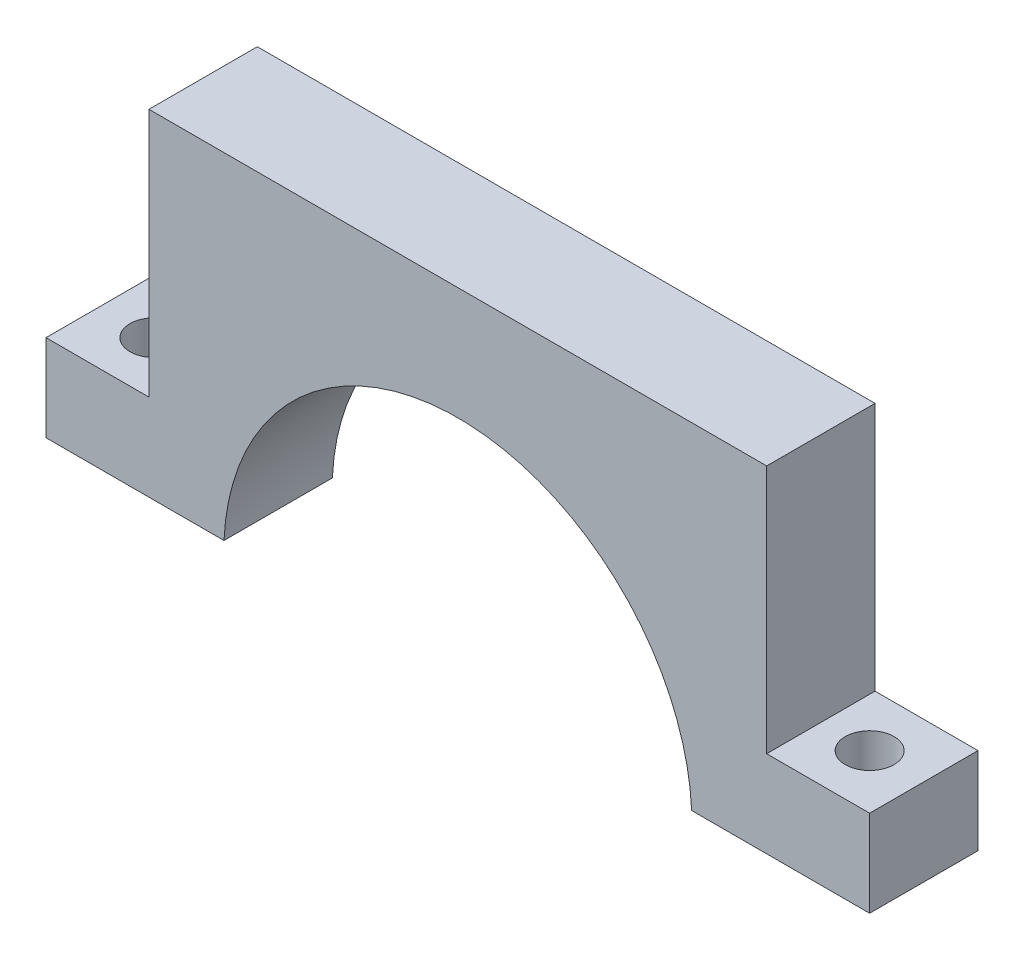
ISO-10303-21;
HEADER;
FILE_DESCRIPTION(('STEP AP214'),'2;1');
FILE_NAME('part.step','',(''),(''),'','','');
FILE_SCHEMA(('AUTOMOTIVE_DESIGN { 1 0 10303 214 1 1 1 1 }'));
ENDSEC;
DATA;
#1=APPLICATION_CONTEXT('core data for automotive mechanical design processes');
#2=APPLICATION_PROTOCOL_DEFINITION('international standard','automotive_design',2000,#1);
#3=PRODUCT_CONTEXT('',#1,'mechanical');
#4=PRODUCT('Part','Part','',(#3));
#5=PRODUCT_RELATED_PRODUCT_CATEGORY('part','',(#4));
#6=PRODUCT_DEFINITION_FORMATION('','',#4);
#7=PRODUCT_DEFINITION_CONTEXT('part definition',#1,'design');
#8=PRODUCT_DEFINITION('design','',#6,#7);
#9=PRODUCT_DEFINITION_SHAPE('','',#8);
#10=(LENGTH_UNIT() NAMED_UNIT(*) SI_UNIT(.MILLI.,.METRE.));
#11=(NAMED_UNIT(*) PLANE_ANGLE_UNIT() SI_UNIT($,.RADIAN.));
#12=(NAMED_UNIT(*) SI_UNIT($,.STERADIAN.) SOLID_ANGLE_UNIT());
#13=UNCERTAINTY_MEASURE_WITH_UNIT(LENGTH_MEASURE(1.E-05),#10,'distance_accuracy_value','');
#14=(GEOMETRIC_REPRESENTATION_CONTEXT(3) GLOBAL_UNCERTAINTY_ASSIGNED_CONTEXT((#13)) GLOBAL_UNIT_ASSIGNED_CONTEXT((#10,
#11,#12)) REPRESENTATION_CONTEXT('',''));
#15=CARTESIAN_POINT('',(0.,0.,0.));
#16=DIRECTION('',(0.,0.,1.));
#17=DIRECTION('',(1.,0.,0.));
#18=AXIS2_PLACEMENT_3D('',#15,#16,#17);
#19=CARTESIAN_POINT('',(241.3,6.35,63.5));
#20=DIRECTION('',(-1.,0.,0.));
#21=DIRECTION('',(0.,-1.,0.));
#22=AXIS2_PLACEMENT_3D('',#19,#20,#21);
#23=PLANE('',#22);
#24=DIRECTION('',(0.,1.,0.));
#25=VECTOR('',#24,1.);
#26=CARTESIAN_POINT('',(241.3,6.35,0.));
#27=LINE('',#26,#25);
#28=CARTESIAN_POINT('',(241.3,6.35,0.));
#29=VERTEX_POINT('',#28);
#30=CARTESIAN_POINT('',(241.3,57.15,0.));
#31=VERTEX_POINT('',#30);
#32=EDGE_CURVE('E455',#29,#31,#27,.T.);
#33=ORIENTED_EDGE('',*,*,#32,.T.);
#34=DIRECTION('',(0.,0.,-1.));
#35=VECTOR('',#34,1.);
#36=CARTESIAN_POINT('',(241.3,57.15,63.5));
#37=LINE('',#36,#35);
#38=CARTESIAN_POINT('',(241.3,57.15,63.5));
#39=VERTEX_POINT('',#38);
#40=EDGE_CURVE('E11',#39,#31,#37,.T.);
#41=ORIENTED_EDGE('',*,*,#40,.F.);
#42=DIRECTION('',(0.,1.,0.));
#43=VECTOR('',#42,1.);
#44=CARTESIAN_POINT('',(241.3,6.35,63.5));
#45=LINE('',#44,#43);
#46=CARTESIAN_POINT('',(241.3,6.35,63.5));
#47=VERTEX_POINT('',#46);
#48=EDGE_CURVE('E491',#47,#39,#45,.T.);
#49=ORIENTED_EDGE('',*,*,#48,.F.);
#50=DIRECTION('',(0.,0.,-1.));
#51=VECTOR('',#50,1.);
#52=CARTESIAN_POINT('',(241.3,6.35,63.5));
#53=LINE('',#52,#51);
#54=EDGE_CURVE('E468',#47,#29,#53,.T.);
#55=ORIENTED_EDGE('',*,*,#54,.T.);
#56=EDGE_LOOP('',(#33,#41,#49,#55));
#57=FACE_BOUND('',#56,.T.);
#58=ADVANCED_FACE('F375',(#57),#23,.F.);
#59=CARTESIAN_POINT('',(180.975,57.15,63.5));
#60=DIRECTION('',(0.,-1.,0.));
#61=DIRECTION('',(0.,0.,-1.));
#62=AXIS2_PLACEMENT_3D('',#59,#60,#61);
#63=PLANE('',#62);
#64=CARTESIAN_POINT('',(209.55,57.1500000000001,31.75));
#65=DIRECTION('',(0.,1.,0.));
#66=DIRECTION('',(0.,0.,1.));
#67=AXIS2_PLACEMENT_3D('',#64,#65,#66);
#68=CIRCLE('',#67,14.2875);
#69=CARTESIAN_POINT('',(209.55,57.15,46.0375));
#70=VERTEX_POINT('',#69);
#71=EDGE_CURVE('E608',#70,#70,#68,.T.);
#72=ORIENTED_EDGE('',*,*,#71,.F.);
#73=EDGE_LOOP('',(#72));
#74=FACE_BOUND('',#73,.T.);
#75=DIRECTION('',(-1.,0.,0.));
#76=VECTOR('',#75,1.);
#77=CARTESIAN_POINT('',(180.975,57.15,0.));
#78=LINE('',#77,#76);
#79=CARTESIAN_POINT('',(180.975,57.15,0.));
#80=VERTEX_POINT('',#79);
#81=EDGE_CURVE('E451',#31,#80,#78,.T.);
#82=ORIENTED_EDGE('',*,*,#81,.T.);
#83=DIRECTION('',(0.,0.,-1.));
#84=VECTOR('',#83,1.);
#85=CARTESIAN_POINT('',(180.975,57.15,63.5));
#86=LINE('',#85,#84);
#87=CARTESIAN_POINT('',(180.975,57.15,63.5));
#88=VERTEX_POINT('',#87);
#89=EDGE_CURVE('E382',#88,#80,#86,.T.);
#90=ORIENTED_EDGE('',*,*,#89,.F.);
#91=DIRECTION('',(-1.,0.,0.));
#92=VECTOR('',#91,1.);
#93=CARTESIAN_POINT('',(180.975,57.15,63.5));
#94=LINE('',#93,#92);
#95=EDGE_CURVE('E464',#39,#88,#94,.T.);
#96=ORIENTED_EDGE('',*,*,#95,.F.);
#97=ORIENTED_EDGE('',*,*,#40,.T.);
#98=EDGE_LOOP('',(#82,#90,#96,#97));
#99=FACE_BOUND('',#98,.T.);
#100=ADVANCED_FACE('F463',(#74,#99),#63,.F.);
#101=CARTESIAN_POINT('',(180.975,203.2,63.5));
#102=DIRECTION('',(-1.,0.,0.));
#103=DIRECTION('',(0.,-1.,0.));
#104=AXIS2_PLACEMENT_3D('',#101,#102,#103);
#105=PLANE('',#104);
#106=DIRECTION('',(0.,1.,0.));
#107=VECTOR('',#106,1.);
#108=CARTESIAN_POINT('',(180.975,203.2,0.));
#109=LINE('',#108,#107);
#110=CARTESIAN_POINT('',(180.975,203.2,0.));
#111=VERTEX_POINT('',#110);
#112=EDGE_CURVE('E457',#80,#111,#109,.T.);
#113=ORIENTED_EDGE('',*,*,#112,.T.);
#114=DIRECTION('',(0.,0.,-1.));
#115=VECTOR('',#114,1.);
#116=CARTESIAN_POINT('',(180.975,203.2,63.5));
#117=LINE('',#116,#115);
#118=CARTESIAN_POINT('',(180.975,203.2,63.5));
#119=VERTEX_POINT('',#118);
#120=EDGE_CURVE('E527',#119,#111,#117,.T.);
#121=ORIENTED_EDGE('',*,*,#120,.F.);
#122=DIRECTION('',(0.,1.,0.));
#123=VECTOR('',#122,1.);
#124=CARTESIAN_POINT('',(180.975,203.2,63.5));
#125=LINE('',#124,#123);
#126=EDGE_CURVE('E494',#88,#119,#125,.T.);
#127=ORIENTED_EDGE('',*,*,#126,.F.);
#128=ORIENTED_EDGE('',*,*,#89,.T.);
#129=EDGE_LOOP('',(#113,#121,#127,#128));
#130=FACE_BOUND('',#129,.T.);
#131=ADVANCED_FACE('F531',(#130),#105,.F.);
#132=CARTESIAN_POINT('',(-180.975,203.2,63.5));
#133=DIRECTION('',(0.,-1.,0.));
#134=DIRECTION('',(1.,0.,0.));
#135=AXIS2_PLACEMENT_3D('',#132,#133,#134);
#136=PLANE('',#135);
#137=DIRECTION('',(-1.,0.,0.));
#138=VECTOR('',#137,1.);
#139=CARTESIAN_POINT('',(-180.975,203.2,0.));
#140=LINE('',#139,#138);
#141=CARTESIAN_POINT('',(-180.975,203.2,0.));
#142=VERTEX_POINT('',#141);
#143=EDGE_CURVE('E477',#111,#142,#140,.T.);
#144=ORIENTED_EDGE('',*,*,#143,.T.);
#145=DIRECTION('',(0.,0.,-1.));
#146=VECTOR('',#145,1.);
#147=CARTESIAN_POINT('',(-180.975,203.2,63.5));
#148=LINE('',#147,#146);
#149=CARTESIAN_POINT('',(-180.975,203.2,63.5));
#150=VERTEX_POINT('',#149);
#151=EDGE_CURVE('E524',#150,#142,#148,.T.);
#152=ORIENTED_EDGE('',*,*,#151,.F.);
#153=DIRECTION('',(-1.,0.,0.));
#154=VECTOR('',#153,1.);
#155=CARTESIAN_POINT('',(-180.975,203.2,63.5));
#156=LINE('',#155,#154);
#157=EDGE_CURVE('E496',#119,#150,#156,.T.);
#158=ORIENTED_EDGE('',*,*,#157,.F.);
#159=ORIENTED_EDGE('',*,*,#120,.T.);
#160=EDGE_LOOP('',(#144,#152,#158,#159));
#161=FACE_BOUND('',#160,.T.);
#162=ADVANCED_FACE('F539',(#161),#136,.F.);
#163=CARTESIAN_POINT('',(-180.975,203.2,63.5));
#164=DIRECTION('',(1.,0.,0.));
#165=DIRECTION('',(0.,1.,0.));
#166=AXIS2_PLACEMENT_3D('',#163,#164,#165);
#167=PLANE('',#166);
#168=DIRECTION('',(0.,-1.,0.));
#169=VECTOR('',#168,1.);
#170=CARTESIAN_POINT('',(-180.975,203.2,0.));
#171=LINE('',#170,#169);
#172=CARTESIAN_POINT('',(-180.975,57.15,0.));
#173=VERTEX_POINT('',#172);
#174=EDGE_CURVE('E479',#142,#173,#171,.T.);
#175=ORIENTED_EDGE('',*,*,#174,.T.);
#176=DIRECTION('',(0.,0.,-1.));
#177=VECTOR('',#176,1.);
#178=CARTESIAN_POINT('',(-180.975,57.15,63.5));
#179=LINE('',#178,#177);
#180=CARTESIAN_POINT('',(-180.975,57.15,63.5));
#181=VERTEX_POINT('',#180);
#182=EDGE_CURVE('E521',#181,#173,#179,.T.);
#183=ORIENTED_EDGE('',*,*,#182,.F.);
#184=DIRECTION('',(0.,-1.,0.));
#185=VECTOR('',#184,1.);
#186=CARTESIAN_POINT('',(-180.975,203.2,63.5));
#187=LINE('',#186,#185);
#188=EDGE_CURVE('E498',#150,#181,#187,.T.);
#189=ORIENTED_EDGE('',*,*,#188,.F.);
#190=ORIENTED_EDGE('',*,*,#151,.T.);
#191=EDGE_LOOP('',(#175,#183,#189,#190));
#192=FACE_BOUND('',#191,.T.);
#193=ADVANCED_FACE('F542',(#192),#167,.F.);
#194=CARTESIAN_POINT('',(-180.975,57.15,63.5));
#195=DIRECTION('',(0.,-1.,0.));
#196=DIRECTION('',(1.,0.,0.));
#197=AXIS2_PLACEMENT_3D('',#194,#195,#196);
#198=PLANE('',#197);
#199=CARTESIAN_POINT('',(-209.55,57.1500000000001,31.75));
#200=DIRECTION('',(0.,1.,0.));
#201=DIRECTION('',(0.,0.,1.));
#202=AXIS2_PLACEMENT_3D('',#199,#200,#201);
#203=CIRCLE('',#202,14.2875);
#204=CARTESIAN_POINT('',(-209.55,57.15,46.0375));
#205=VERTEX_POINT('',#204);
#206=EDGE_CURVE('E472',#205,#205,#203,.T.);
#207=ORIENTED_EDGE('',*,*,#206,.F.);
#208=EDGE_LOOP('',(#207));
#209=FACE_BOUND('',#208,.T.);
#210=DIRECTION('',(-1.,0.,0.));
#211=VECTOR('',#210,1.);
#212=CARTESIAN_POINT('',(-180.975,57.15,0.));
#213=LINE('',#212,#211);
#214=CARTESIAN_POINT('',(-241.3,57.15,0.));
#215=VERTEX_POINT('',#214);
#216=EDGE_CURVE('E481',#173,#215,#213,.T.);
#217=ORIENTED_EDGE('',*,*,#216,.T.);
#218=DIRECTION('',(0.,0.,-1.));
#219=VECTOR('',#218,1.);
#220=CARTESIAN_POINT('',(-241.3,57.15,63.5));
#221=LINE('',#220,#219);
#222=CARTESIAN_POINT('',(-241.3,57.15,63.5));
#223=VERTEX_POINT('',#222);
#224=EDGE_CURVE('E518',#223,#215,#221,.T.);
#225=ORIENTED_EDGE('',*,*,#224,.F.);
#226=DIRECTION('',(-1.,0.,0.));
#227=VECTOR('',#226,1.);
#228=CARTESIAN_POINT('',(-180.975,57.15,63.5));
#229=LINE('',#228,#227);
#230=EDGE_CURVE('E500',#181,#223,#229,.T.);
#231=ORIENTED_EDGE('',*,*,#230,.F.);
#232=ORIENTED_EDGE('',*,*,#182,.T.);
#233=EDGE_LOOP('',(#217,#225,#231,#232));
#234=FACE_BOUND('',#233,.T.);
#235=ADVANCED_FACE('F547',(#209,#234),#198,.F.);
#236=CARTESIAN_POINT('',(-241.3,6.35,63.5));
#237=DIRECTION('',(1.,0.,0.));
#238=DIRECTION('',(0.,1.,0.));
#239=AXIS2_PLACEMENT_3D('',#236,#237,#238);
#240=PLANE('',#239);
#241=DIRECTION('',(0.,-1.,0.));
#242=VECTOR('',#241,1.);
#243=CARTESIAN_POINT('',(-241.3,6.35,0.));
#244=LINE('',#243,#242);
#245=CARTESIAN_POINT('',(-241.3,6.35,0.));
#246=VERTEX_POINT('',#245);
#247=EDGE_CURVE('E483',#215,#246,#244,.T.);
#248=ORIENTED_EDGE('',*,*,#247,.T.);
#249=DIRECTION('',(0.,0.,-1.));
#250=VECTOR('',#249,1.);
#251=CARTESIAN_POINT('',(-241.3,6.35,63.5));
#252=LINE('',#251,#250);
#253=CARTESIAN_POINT('',(-241.3,6.35,63.5));
#254=VERTEX_POINT('',#253);
#255=EDGE_CURVE('E515',#254,#246,#252,.T.);
#256=ORIENTED_EDGE('',*,*,#255,.F.);
#257=DIRECTION('',(0.,-1.,0.));
#258=VECTOR('',#257,1.);
#259=CARTESIAN_POINT('',(-241.3,6.35,63.5));
#260=LINE('',#259,#258);
#261=EDGE_CURVE('E502',#223,#254,#260,.T.);
#262=ORIENTED_EDGE('',*,*,#261,.F.);
#263=ORIENTED_EDGE('',*,*,#224,.T.);
#264=EDGE_LOOP('',(#248,#256,#262,#263));
#265=FACE_BOUND('',#264,.T.);
#266=ADVANCED_FACE('F553',(#265),#240,.F.);
#267=CARTESIAN_POINT('',(-241.3,6.35,63.5));
#268=DIRECTION('',(0.,1.,0.));
#269=DIRECTION('',(-1.,0.,0.));
#270=AXIS2_PLACEMENT_3D('',#267,#268,#269);
#271=PLANE('',#270);
#272=CARTESIAN_POINT('',(-209.55,6.34999999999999,31.75));
#273=DIRECTION('',(0.,1.,0.));
#274=DIRECTION('',(0.,0.,1.));
#275=AXIS2_PLACEMENT_3D('',#272,#273,#274);
#276=CIRCLE('',#275,14.2875);
#277=CARTESIAN_POINT('',(-209.55,6.34999999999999,46.0375));
#278=VERTEX_POINT('',#277);
#279=EDGE_CURVE('E469',#278,#278,#276,.T.);
#280=ORIENTED_EDGE('',*,*,#279,.T.);
#281=EDGE_LOOP('',(#280));
#282=FACE_BOUND('',#281,.T.);
#283=DIRECTION('',(1.,0.,0.));
#284=VECTOR('',#283,1.);
#285=CARTESIAN_POINT('',(-241.3,6.35,0.));
#286=LINE('',#285,#284);
#287=CARTESIAN_POINT('',(-137.012930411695,6.34999999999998,0.));
#288=VERTEX_POINT('',#287);
#289=EDGE_CURVE('E485',#246,#288,#286,.T.);
#290=ORIENTED_EDGE('',*,*,#289,.T.);
#291=DIRECTION('',(0.,0.,-1.));
#292=VECTOR('',#291,1.);
#293=CARTESIAN_POINT('',(-137.012930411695,6.34999999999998,63.5));
#294=LINE('',#293,#292);
#295=CARTESIAN_POINT('',(-137.012930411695,6.34999999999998,63.5));
#296=VERTEX_POINT('',#295);
#297=EDGE_CURVE('E512',#296,#288,#294,.T.);
#298=ORIENTED_EDGE('',*,*,#297,.F.);
#299=DIRECTION('',(1.,0.,0.));
#300=VECTOR('',#299,1.);
#301=CARTESIAN_POINT('',(-241.3,6.35,63.5));
#302=LINE('',#301,#300);
#303=EDGE_CURVE('E504',#254,#296,#302,.T.);
#304=ORIENTED_EDGE('',*,*,#303,.F.);
#305=ORIENTED_EDGE('',*,*,#255,.T.);
#306=EDGE_LOOP('',(#290,#298,#304,#305));
#307=FACE_BOUND('',#306,.T.);
#308=ADVANCED_FACE('F557',(#282,#307),#271,.F.);
#309=CARTESIAN_POINT('',(0.,0.,63.5));
#310=DIRECTION('',(0.,0.,-1.));
#311=DIRECTION('',(-1.,0.,0.));
#312=AXIS2_PLACEMENT_3D('',#309,#310,#311);
#313=CYLINDRICAL_SURFACE('',#312,137.16);
#314=CARTESIAN_POINT('',(0.,0.,0.));
#315=DIRECTION('',(0.,0.,-1.));
#316=DIRECTION('',(1.,0.,0.));
#317=AXIS2_PLACEMENT_3D('',#314,#315,#316);
#318=CIRCLE('',#317,137.16);
#319=CARTESIAN_POINT('',(137.012930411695,6.35,0.));
#320=VERTEX_POINT('',#319);
#321=EDGE_CURVE('E487',#288,#320,#318,.T.);
#322=ORIENTED_EDGE('',*,*,#321,.T.);
#323=DIRECTION('',(0.,0.,-1.));
#324=VECTOR('',#323,1.);
#325=CARTESIAN_POINT('',(137.012930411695,6.35,63.5));
#326=LINE('',#325,#324);
#327=CARTESIAN_POINT('',(137.012930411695,6.35,63.5));
#328=VERTEX_POINT('',#327);
#329=EDGE_CURVE('E509',#328,#320,#326,.T.);
#330=ORIENTED_EDGE('',*,*,#329,.F.);
#331=CARTESIAN_POINT('',(0.,0.,63.5));
#332=DIRECTION('',(0.,0.,-1.));
#333=DIRECTION('',(1.,0.,0.));
#334=AXIS2_PLACEMENT_3D('',#331,#332,#333);
#335=CIRCLE('',#334,137.16);
#336=EDGE_CURVE('E394',#296,#328,#335,.T.);
#337=ORIENTED_EDGE('',*,*,#336,.F.);
#338=ORIENTED_EDGE('',*,*,#297,.T.);
#339=EDGE_LOOP('',(#322,#330,#337,#338));
#340=FACE_BOUND('',#339,.T.);
#341=ADVANCED_FACE('F560',(#340),#313,.F.);
#342=CARTESIAN_POINT('',(137.012930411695,6.35,63.5));
#343=DIRECTION('',(0.,1.,0.));
#344=DIRECTION('',(-1.,0.,0.));
#345=AXIS2_PLACEMENT_3D('',#342,#343,#344);
#346=PLANE('',#345);
#347=CARTESIAN_POINT('',(209.55,6.34999999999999,31.75));
#348=DIRECTION('',(0.,1.,0.));
#349=DIRECTION('',(0.,0.,1.));
#350=AXIS2_PLACEMENT_3D('',#347,#348,#349);
#351=CIRCLE('',#350,14.2875);
#352=CARTESIAN_POINT('',(209.55,6.34999999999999,46.0375));
#353=VERTEX_POINT('',#352);
#354=EDGE_CURVE('E607',#353,#353,#351,.T.);
#355=ORIENTED_EDGE('',*,*,#354,.T.);
#356=EDGE_LOOP('',(#355));
#357=FACE_BOUND('',#356,.T.);
#358=DIRECTION('',(1.,0.,0.));
#359=VECTOR('',#358,1.);
#360=CARTESIAN_POINT('',(137.012930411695,6.35,0.));
#361=LINE('',#360,#359);
#362=EDGE_CURVE('E489',#320,#29,#361,.T.);
#363=ORIENTED_EDGE('',*,*,#362,.T.);
#364=ORIENTED_EDGE('',*,*,#54,.F.);
#365=DIRECTION('',(1.,0.,0.));
#366=VECTOR('',#365,1.);
#367=CARTESIAN_POINT('',(137.012930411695,6.35,63.5));
#368=LINE('',#367,#366);
#369=EDGE_CURVE('E389',#328,#47,#368,.T.);
#370=ORIENTED_EDGE('',*,*,#369,.F.);
#371=ORIENTED_EDGE('',*,*,#329,.T.);
#372=EDGE_LOOP('',(#363,#364,#370,#371));
#373=FACE_BOUND('',#372,.T.);
#374=ADVANCED_FACE('F562',(#357,#373),#346,.F.);
#375=CARTESIAN_POINT('',(0.,0.,63.5));
#376=DIRECTION('',(0.,0.,1.));
#377=DIRECTION('',(1.,0.,0.));
#378=AXIS2_PLACEMENT_3D('',#375,#376,#377);
#379=PLANE('',#378);
#380=ORIENTED_EDGE('',*,*,#48,.T.);
#381=ORIENTED_EDGE('',*,*,#95,.T.);
#382=ORIENTED_EDGE('',*,*,#126,.T.);
#383=ORIENTED_EDGE('',*,*,#157,.T.);
#384=ORIENTED_EDGE('',*,*,#188,.T.);
#385=ORIENTED_EDGE('',*,*,#230,.T.);
#386=ORIENTED_EDGE('',*,*,#261,.T.);
#387=ORIENTED_EDGE('',*,*,#303,.T.);
#388=ORIENTED_EDGE('',*,*,#336,.T.);
#389=ORIENTED_EDGE('',*,*,#369,.T.);
#390=EDGE_LOOP('',(#380,#381,#382,#383,#384,#385,#386,#387,#388,#389));
#391=FACE_BOUND('',#390,.T.);
#392=ADVANCED_FACE('F534',(#391),#379,.T.);
#393=CARTESIAN_POINT('',(0.,0.,0.));
#394=DIRECTION('',(0.,0.,1.));
#395=DIRECTION('',(1.,0.,0.));
#396=AXIS2_PLACEMENT_3D('',#393,#394,#395);
#397=PLANE('',#396);
#398=ORIENTED_EDGE('',*,*,#32,.F.);
#399=ORIENTED_EDGE('',*,*,#362,.F.);
#400=ORIENTED_EDGE('',*,*,#321,.F.);
#401=ORIENTED_EDGE('',*,*,#289,.F.);
#402=ORIENTED_EDGE('',*,*,#247,.F.);
#403=ORIENTED_EDGE('',*,*,#216,.F.);
#404=ORIENTED_EDGE('',*,*,#174,.F.);
#405=ORIENTED_EDGE('',*,*,#143,.F.);
#406=ORIENTED_EDGE('',*,*,#112,.F.);
#407=ORIENTED_EDGE('',*,*,#81,.F.);
#408=EDGE_LOOP('',(#398,#399,#400,#401,#402,#403,#404,#405,#406,#407));
#409=FACE_BOUND('',#408,.T.);
#410=ADVANCED_FACE('F452',(#409),#397,.F.);
#411=CARTESIAN_POINT('',(-209.55,6.34999999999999,31.75));
#412=DIRECTION('',(0.,1.,0.));
#413=DIRECTION('',(0.,0.,1.));
#414=AXIS2_PLACEMENT_3D('',#411,#412,#413);
#415=CYLINDRICAL_SURFACE('',#414,14.2875);
#416=CARTESIAN_POINT('',(-209.55,6.34999999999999,46.0375));
#417=CARTESIAN_POINT('',(-209.55,6.87916666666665,46.0375));
#418=CARTESIAN_POINT('',(-209.55,7.40833333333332,46.0375));
#419=CARTESIAN_POINT('',(-209.55,8.46666666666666,46.0375));
#420=CARTESIAN_POINT('',(-209.55,8.99583333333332,46.0375));
#421=CARTESIAN_POINT('',(-209.55,10.0541666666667,46.0375));
#422=CARTESIAN_POINT('',(-209.55,10.5833333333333,46.0375));
#423=CARTESIAN_POINT('',(-209.55,11.6416666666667,46.0375));
#424=CARTESIAN_POINT('',(-209.55,12.1708333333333,46.0375));
#425=CARTESIAN_POINT('',(-209.55,13.2291666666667,46.0375));
#426=CARTESIAN_POINT('',(-209.55,13.7583333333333,46.0375));
#427=CARTESIAN_POINT('',(-209.55,14.8166666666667,46.0375));
#428=CARTESIAN_POINT('',(-209.55,15.3458333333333,46.0375));
#429=CARTESIAN_POINT('',(-209.55,16.4041666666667,46.0375));
#430=CARTESIAN_POINT('',(-209.55,16.9333333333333,46.0375));
#431=CARTESIAN_POINT('',(-209.55,17.9916666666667,46.0375));
#432=CARTESIAN_POINT('',(-209.55,18.5208333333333,46.0375));
#433=CARTESIAN_POINT('',(-209.55,19.5791666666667,46.0375));
#434=CARTESIAN_POINT('',(-209.55,20.1083333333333,46.0375));
#435=CARTESIAN_POINT('',(-209.55,21.1666666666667,46.0375));
#436=CARTESIAN_POINT('',(-209.55,21.6958333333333,46.0375));
#437=CARTESIAN_POINT('',(-209.55,22.7541666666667,46.0375));
#438=CARTESIAN_POINT('',(-209.55,23.2833333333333,46.0375));
#439=CARTESIAN_POINT('',(-209.55,24.3416666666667,46.0375));
#440=CARTESIAN_POINT('',(-209.55,24.8708333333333,46.0375));
#441=CARTESIAN_POINT('',(-209.55,25.9291666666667,46.0375));
#442=CARTESIAN_POINT('',(-209.55,26.4583333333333,46.0375));
#443=CARTESIAN_POINT('',(-209.55,27.5166666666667,46.0375));
#444=CARTESIAN_POINT('',(-209.55,28.0458333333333,46.0375));
#445=CARTESIAN_POINT('',(-209.55,29.1041666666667,46.0375));
#446=CARTESIAN_POINT('',(-209.55,29.6333333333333,46.0375));
#447=CARTESIAN_POINT('',(-209.55,30.6916666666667,46.0375));
#448=CARTESIAN_POINT('',(-209.55,31.2208333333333,46.0375));
#449=CARTESIAN_POINT('',(-209.55,32.2791666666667,46.0375));
#450=CARTESIAN_POINT('',(-209.55,32.8083333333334,46.0375));
#451=CARTESIAN_POINT('',(-209.55,33.8666666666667,46.0375));
#452=CARTESIAN_POINT('',(-209.55,34.3958333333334,46.0375));
#453=CARTESIAN_POINT('',(-209.55,35.4541666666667,46.0375));
#454=CARTESIAN_POINT('',(-209.55,35.9833333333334,46.0375));
#455=CARTESIAN_POINT('',(-209.55,37.0416666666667,46.0375));
#456=CARTESIAN_POINT('',(-209.55,37.5708333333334,46.0375));
#457=CARTESIAN_POINT('',(-209.55,38.6291666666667,46.0375));
#458=CARTESIAN_POINT('',(-209.55,39.1583333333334,46.0375));
#459=CARTESIAN_POINT('',(-209.55,40.2166666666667,46.0375));
#460=CARTESIAN_POINT('',(-209.55,40.7458333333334,46.0375));
#461=CARTESIAN_POINT('',(-209.55,41.8041666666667,46.0375));
#462=CARTESIAN_POINT('',(-209.55,42.3333333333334,46.0375));
#463=CARTESIAN_POINT('',(-209.55,43.3916666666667,46.0375));
#464=CARTESIAN_POINT('',(-209.55,43.9208333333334,46.0375));
#465=CARTESIAN_POINT('',(-209.55,44.9791666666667,46.0375));
#466=CARTESIAN_POINT('',(-209.55,45.5083333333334,46.0375));
#467=CARTESIAN_POINT('',(-209.55,46.5666666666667,46.0375));
#468=CARTESIAN_POINT('',(-209.55,47.0958333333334,46.0375));
#469=CARTESIAN_POINT('',(-209.55,48.1541666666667,46.0375));
#470=CARTESIAN_POINT('',(-209.55,48.6833333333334,46.0375));
#471=CARTESIAN_POINT('',(-209.55,49.7416666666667,46.0375));
#472=CARTESIAN_POINT('',(-209.55,50.2708333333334,46.0375));
#473=CARTESIAN_POINT('',(-209.55,51.3291666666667,46.0375));
#474=CARTESIAN_POINT('',(-209.55,51.8583333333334,46.0375));
#475=CARTESIAN_POINT('',(-209.55,52.9166666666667,46.0375));
#476=CARTESIAN_POINT('',(-209.55,53.4458333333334,46.0375));
#477=CARTESIAN_POINT('',(-209.55,54.5041666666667,46.0375));
#478=CARTESIAN_POINT('',(-209.55,55.0333333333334,46.0375));
#479=CARTESIAN_POINT('',(-209.55,56.0916666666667,46.0375));
#480=CARTESIAN_POINT('',(-209.55,56.6208333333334,46.0375));
#481=CARTESIAN_POINT('',(-209.55,57.15,46.0375));
#482=B_SPLINE_CURVE_WITH_KNOTS('',3,(#416,#417,#418,#419,#420,#421,#422,#423,#424,#425,#426,
#427,#428,#429,#430,#431,#432,#433,#434,#435,#436,#437,#438,#439,#440,#441,#442,#443,#444,#445,
#446,#447,#448,#449,#450,#451,#452,#453,#454,#455,#456,#457,#458,#459,#460,#461,#462,#463,#464,
#465,#466,#467,#468,#469,#470,#471,#472,#473,#474,#475,#476,#477,#478,#479,#480,#481),
.UNSPECIFIED.,.F.,.F.,(4,2,2,2,2,2,2,2,2,2,2,2,2,2,2,2,2,2,2,2,2,2,2,2,2,2,2,2,2,2,2,2,4),(0.,
1.5875,3.175,4.76250000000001,6.35000000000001,7.93750000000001,9.52500000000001,11.1125,12.7,
14.2875,15.875,17.4625,19.05,20.6375,22.225,23.8125,25.4,26.9875,28.575,30.1625,31.75,33.3375,
34.925,36.5125,38.1,39.6875,41.275,42.8625,44.4500000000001,46.0375000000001,47.6250000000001,
49.2125000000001,50.8000000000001),.UNSPECIFIED.);
#483=EDGE_CURVE('BSEAM601',#278,#205,#482,.T.);
#484=ORIENTED_EDGE('',*,*,#279,.F.);
#485=ORIENTED_EDGE('',*,*,#206,.T.);
#486=ORIENTED_EDGE('',*,*,#483,.T.);
#487=ORIENTED_EDGE('',*,*,#483,.F.);
#488=EDGE_LOOP('',(#484,#486,#485,#487));
#489=FACE_BOUND('',#488,.T.);
#490=ADVANCED_FACE('F601',(#489),#415,.F.);
#491=CARTESIAN_POINT('',(209.55,6.34999999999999,31.75));
#492=DIRECTION('',(0.,1.,0.));
#493=DIRECTION('',(0.,0.,1.));
#494=AXIS2_PLACEMENT_3D('',#491,#492,#493);
#495=CYLINDRICAL_SURFACE('',#494,14.2875);
#496=CARTESIAN_POINT('',(209.55,6.34999999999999,46.0375));
#497=CARTESIAN_POINT('',(209.55,6.87916666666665,46.0375));
#498=CARTESIAN_POINT('',(209.55,7.40833333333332,46.0375));
#499=CARTESIAN_POINT('',(209.55,8.46666666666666,46.0375));
#500=CARTESIAN_POINT('',(209.55,8.99583333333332,46.0375));
#501=CARTESIAN_POINT('',(209.55,10.0541666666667,46.0375));
#502=CARTESIAN_POINT('',(209.55,10.5833333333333,46.0375));
#503=CARTESIAN_POINT('',(209.55,11.6416666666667,46.0375));
#504=CARTESIAN_POINT('',(209.55,12.1708333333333,46.0375));
#505=CARTESIAN_POINT('',(209.55,13.2291666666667,46.0375));
#506=CARTESIAN_POINT('',(209.55,13.7583333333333,46.0375));
#507=CARTESIAN_POINT('',(209.55,14.8166666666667,46.0375));
#508=CARTESIAN_POINT('',(209.55,15.3458333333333,46.0375));
#509=CARTESIAN_POINT('',(209.55,16.4041666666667,46.0375));
#510=CARTESIAN_POINT('',(209.55,16.9333333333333,46.0375));
#511=CARTESIAN_POINT('',(209.55,17.9916666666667,46.0375));
#512=CARTESIAN_POINT('',(209.55,18.5208333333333,46.0375));
#513=CARTESIAN_POINT('',(209.55,19.5791666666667,46.0375));
#514=CARTESIAN_POINT('',(209.55,20.1083333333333,46.0375));
#515=CARTESIAN_POINT('',(209.55,21.1666666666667,46.0375));
#516=CARTESIAN_POINT('',(209.55,21.6958333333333,46.0375));
#517=CARTESIAN_POINT('',(209.55,22.7541666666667,46.0375));
#518=CARTESIAN_POINT('',(209.55,23.2833333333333,46.0375));
#519=CARTESIAN_POINT('',(209.55,24.3416666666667,46.0375));
#520=CARTESIAN_POINT('',(209.55,24.8708333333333,46.0375));
#521=CARTESIAN_POINT('',(209.55,25.9291666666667,46.0375));
#522=CARTESIAN_POINT('',(209.55,26.4583333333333,46.0375));
#523=CARTESIAN_POINT('',(209.55,27.5166666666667,46.0375));
#524=CARTESIAN_POINT('',(209.55,28.0458333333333,46.0375));
#525=CARTESIAN_POINT('',(209.55,29.1041666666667,46.0375));
#526=CARTESIAN_POINT('',(209.55,29.6333333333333,46.0375));
#527=CARTESIAN_POINT('',(209.55,30.6916666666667,46.0375));
#528=CARTESIAN_POINT('',(209.55,31.2208333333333,46.0375));
#529=CARTESIAN_POINT('',(209.55,32.2791666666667,46.0375));
#530=CARTESIAN_POINT('',(209.55,32.8083333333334,46.0375));
#531=CARTESIAN_POINT('',(209.55,33.8666666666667,46.0375));
#532=CARTESIAN_POINT('',(209.55,34.3958333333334,46.0375));
#533=CARTESIAN_POINT('',(209.55,35.4541666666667,46.0375));
#534=CARTESIAN_POINT('',(209.55,35.9833333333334,46.0375));
#535=CARTESIAN_POINT('',(209.55,37.0416666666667,46.0375));
#536=CARTESIAN_POINT('',(209.55,37.5708333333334,46.0375));
#537=CARTESIAN_POINT('',(209.55,38.6291666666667,46.0375));
#538=CARTESIAN_POINT('',(209.55,39.1583333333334,46.0375));
#539=CARTESIAN_POINT('',(209.55,40.2166666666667,46.0375));
#540=CARTESIAN_POINT('',(209.55,40.7458333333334,46.0375));
#541=CARTESIAN_POINT('',(209.55,41.8041666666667,46.0375));
#542=CARTESIAN_POINT('',(209.55,42.3333333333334,46.0375));
#543=CARTESIAN_POINT('',(209.55,43.3916666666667,46.0375));
#544=CARTESIAN_POINT('',(209.55,43.9208333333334,46.0375));
#545=CARTESIAN_POINT('',(209.55,44.9791666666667,46.0375));
#546=CARTESIAN_POINT('',(209.55,45.5083333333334,46.0375));
#547=CARTESIAN_POINT('',(209.55,46.5666666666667,46.0375));
#548=CARTESIAN_POINT('',(209.55,47.0958333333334,46.0375));
#549=CARTESIAN_POINT('',(209.55,48.1541666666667,46.0375));
#550=CARTESIAN_POINT('',(209.55,48.6833333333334,46.0375));
#551=CARTESIAN_POINT('',(209.55,49.7416666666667,46.0375));
#552=CARTESIAN_POINT('',(209.55,50.2708333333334,46.0375));
#553=CARTESIAN_POINT('',(209.55,51.3291666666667,46.0375));
#554=CARTESIAN_POINT('',(209.55,51.8583333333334,46.0375));
#555=CARTESIAN_POINT('',(209.55,52.9166666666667,46.0375));
#556=CARTESIAN_POINT('',(209.55,53.4458333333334,46.0375));
#557=CARTESIAN_POINT('',(209.55,54.5041666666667,46.0375));
#558=CARTESIAN_POINT('',(209.55,55.0333333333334,46.0375));
#559=CARTESIAN_POINT('',(209.55,56.0916666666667,46.0375));
#560=CARTESIAN_POINT('',(209.55,56.6208333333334,46.0375));
#561=CARTESIAN_POINT('',(209.55,57.15,46.0375));
#562=B_SPLINE_CURVE_WITH_KNOTS('',3,(#496,#497,#498,#499,#500,#501,#502,#503,#504,#505,#506,
#507,#508,#509,#510,#511,#512,#513,#514,#515,#516,#517,#518,#519,#520,#521,#522,#523,#524,#525,
#526,#527,#528,#529,#530,#531,#532,#533,#534,#535,#536,#537,#538,#539,#540,#541,#542,#543,#544,
#545,#546,#547,#548,#549,#550,#551,#552,#553,#554,#555,#556,#557,#558,#559,#560,#561),
.UNSPECIFIED.,.F.,.F.,(4,2,2,2,2,2,2,2,2,2,2,2,2,2,2,2,2,2,2,2,2,2,2,2,2,2,2,2,2,2,2,2,4),(0.,
1.5875,3.175,4.76250000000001,6.35000000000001,7.93750000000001,9.52500000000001,11.1125,12.7,
14.2875,15.875,17.4625,19.05,20.6375,22.225,23.8125,25.4,26.9875,28.575,30.1625,31.75,33.3375,
34.925,36.5125,38.1,39.6875,41.275,42.8625,44.4500000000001,46.0375000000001,47.6250000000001,
49.2125000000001,50.8000000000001),.UNSPECIFIED.);
#563=EDGE_CURVE('BSEAM603',#353,#70,#562,.T.);
#564=ORIENTED_EDGE('',*,*,#354,.F.);
#565=ORIENTED_EDGE('',*,*,#71,.T.);
#566=ORIENTED_EDGE('',*,*,#563,.T.);
#567=ORIENTED_EDGE('',*,*,#563,.F.);
#568=EDGE_LOOP('',(#564,#566,#565,#567));
#569=FACE_BOUND('',#568,.T.);
#570=ADVANCED_FACE('F603',(#569),#495,.F.);
#571=CLOSED_SHELL('',(#58,#100,#131,#162,#193,#235,#266,#308,#341,#374,#392,#410,#490,#570));
#572=MANIFOLD_SOLID_BREP('B2',#571);
#573=ADVANCED_BREP_SHAPE_REPRESENTATION('',(#18,#572),#14);
#574=SHAPE_DEFINITION_REPRESENTATION(#9,#573);
ENDSEC;
END-ISO-10303-21;
